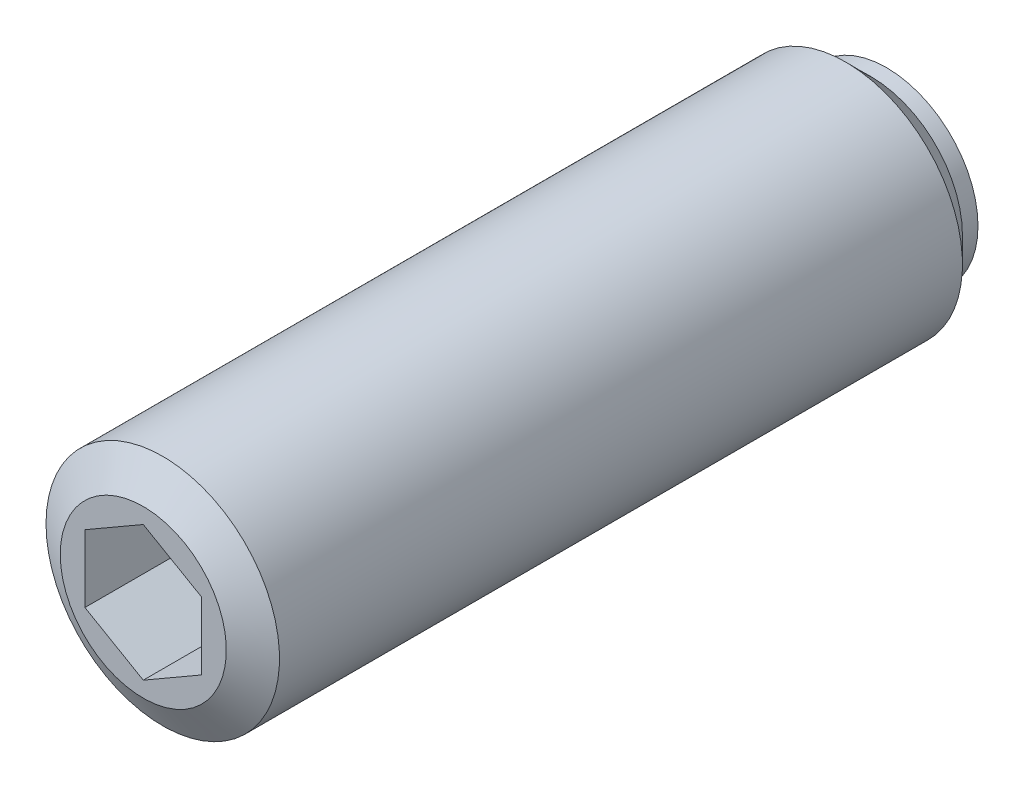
ISO-10303-21;
HEADER;
FILE_DESCRIPTION(('STEP AP214'),'2;1');
FILE_NAME('part.step','',(''),(''),'','','');
FILE_SCHEMA(('AUTOMOTIVE_DESIGN { 1 0 10303 214 1 1 1 1 }'));
ENDSEC;
DATA;
#1=APPLICATION_CONTEXT('core data for automotive mechanical design processes');
#2=APPLICATION_PROTOCOL_DEFINITION('international standard','automotive_design',2000,#1);
#3=PRODUCT_CONTEXT('',#1,'mechanical');
#4=PRODUCT('Part','Part','',(#3));
#5=PRODUCT_RELATED_PRODUCT_CATEGORY('part','',(#4));
#6=PRODUCT_DEFINITION_FORMATION('','',#4);
#7=PRODUCT_DEFINITION_CONTEXT('part definition',#1,'design');
#8=PRODUCT_DEFINITION('design','',#6,#7);
#9=PRODUCT_DEFINITION_SHAPE('','',#8);
#10=(LENGTH_UNIT() NAMED_UNIT(*) SI_UNIT(.MILLI.,.METRE.));
#11=(NAMED_UNIT(*) PLANE_ANGLE_UNIT() SI_UNIT($,.RADIAN.));
#12=(NAMED_UNIT(*) SI_UNIT($,.STERADIAN.) SOLID_ANGLE_UNIT());
#13=UNCERTAINTY_MEASURE_WITH_UNIT(LENGTH_MEASURE(1.E-05),#10,'distance_accuracy_value','');
#14=(GEOMETRIC_REPRESENTATION_CONTEXT(3) GLOBAL_UNCERTAINTY_ASSIGNED_CONTEXT((#13)) GLOBAL_UNIT_ASSIGNED_CONTEXT((#10,
#11,#12)) REPRESENTATION_CONTEXT('',''));
#15=CARTESIAN_POINT('',(0.,0.,0.));
#16=DIRECTION('',(0.,0.,1.));
#17=DIRECTION('',(1.,0.,0.));
#18=AXIS2_PLACEMENT_3D('',#15,#16,#17);
#19=CARTESIAN_POINT('',(0.,0.,2.));
#20=DIRECTION('',(0.,0.,1.));
#21=DIRECTION('',(0.,-1.,0.));
#22=AXIS2_PLACEMENT_3D('',#19,#20,#21);
#23=SPHERICAL_SURFACE('',#22,2.);
#24=CARTESIAN_POINT('',(0.,0.,0.9));
#25=DIRECTION('',(0.,0.,1.));
#26=DIRECTION('',(-1.,0.,0.));
#27=AXIS2_PLACEMENT_3D('',#24,#25,#26);
#28=CIRCLE('',#27,1.67032930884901);
#29=CARTESIAN_POINT('',(-1.67032930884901,0.,0.9));
#30=VERTEX_POINT('',#29);
#31=EDGE_CURVE('E9',#30,#30,#28,.T.);
#32=ORIENTED_EDGE('',*,*,#31,.F.);
#33=EDGE_LOOP('',(#32));
#34=FACE_BOUND('',#33,.T.);
#35=ADVANCED_FACE('F14',(#34),#23,.T.);
#36=CARTESIAN_POINT('',(0.,2.35,0.9));
#37=DIRECTION('',(0.,0.,1.));
#38=DIRECTION('',(-1.,0.,0.));
#39=AXIS2_PLACEMENT_3D('',#36,#37,#38);
#40=PLANE('',#39);
#41=CARTESIAN_POINT('',(0.,0.,0.9));
#42=DIRECTION('',(0.,0.,1.));
#43=DIRECTION('',(-1.,0.,0.));
#44=AXIS2_PLACEMENT_3D('',#41,#42,#43);
#45=CIRCLE('',#44,2.35);
#46=CARTESIAN_POINT('',(-2.35,0.,0.9));
#47=VERTEX_POINT('',#46);
#48=EDGE_CURVE('E21',#47,#47,#45,.T.);
#49=ORIENTED_EDGE('',*,*,#48,.F.);
#50=EDGE_LOOP('',(#49));
#51=FACE_BOUND('',#50,.T.);
#52=ORIENTED_EDGE('',*,*,#31,.T.);
#53=EDGE_LOOP('',(#52));
#54=FACE_BOUND('',#53,.T.);
#55=ADVANCED_FACE('F138',(#51,#54),#40,.F.);
#56=CARTESIAN_POINT('',(0.,0.,21.3950749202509));
#57=DIRECTION('',(0.,0.,1.));
#58=DIRECTION('',(-1.,0.,0.));
#59=AXIS2_PLACEMENT_3D('',#56,#57,#58);
#60=CYLINDRICAL_SURFACE('',#59,2.35);
#61=CARTESIAN_POINT('',(0.,0.,1.3));
#62=DIRECTION('',(0.,0.,1.));
#63=DIRECTION('',(-1.,0.,0.));
#64=AXIS2_PLACEMENT_3D('',#61,#62,#63);
#65=CIRCLE('',#64,2.35);
#66=CARTESIAN_POINT('',(-2.35,0.,1.3));
#67=VERTEX_POINT('',#66);
#68=EDGE_CURVE('E131',#67,#67,#65,.T.);
#69=ORIENTED_EDGE('',*,*,#68,.F.);
#70=EDGE_LOOP('',(#69));
#71=FACE_BOUND('',#70,.T.);
#72=ORIENTED_EDGE('',*,*,#48,.T.);
#73=EDGE_LOOP('',(#72));
#74=FACE_BOUND('',#73,.T.);
#75=ADVANCED_FACE('F136',(#71,#74),#60,.T.);
#76=CARTESIAN_POINT('',(0.,0.,1.3));
#77=DIRECTION('',(0.,0.,1.));
#78=DIRECTION('',(-1.,0.,0.));
#79=AXIS2_PLACEMENT_3D('',#76,#77,#78);
#80=CONICAL_SURFACE('',#79,2.35,0.785398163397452);
#81=CARTESIAN_POINT('',(0.,0.,1.95));
#82=DIRECTION('',(0.,0.,1.));
#83=DIRECTION('',(-1.,0.,0.));
#84=AXIS2_PLACEMENT_3D('',#81,#82,#83);
#85=CIRCLE('',#84,3.);
#86=CARTESIAN_POINT('',(-3.,0.,1.95));
#87=VERTEX_POINT('',#86);
#88=EDGE_CURVE('E128',#87,#87,#85,.T.);
#89=ORIENTED_EDGE('',*,*,#88,.F.);
#90=EDGE_LOOP('',(#89));
#91=FACE_BOUND('',#90,.T.);
#92=ORIENTED_EDGE('',*,*,#68,.T.);
#93=EDGE_LOOP('',(#92));
#94=FACE_BOUND('',#93,.T.);
#95=ADVANCED_FACE('F161',(#91,#94),#80,.T.);
#96=CARTESIAN_POINT('',(0.,0.,21.3950749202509));
#97=DIRECTION('',(0.,0.,1.));
#98=DIRECTION('',(-1.,0.,0.));
#99=AXIS2_PLACEMENT_3D('',#96,#97,#98);
#100=CYLINDRICAL_SURFACE('',#99,3.);
#101=CARTESIAN_POINT('',(0.,0.,19.5));
#102=DIRECTION('',(0.,0.,1.));
#103=DIRECTION('',(-1.,0.,0.));
#104=AXIS2_PLACEMENT_3D('',#101,#102,#103);
#105=CIRCLE('',#104,3.);
#106=CARTESIAN_POINT('',(-3.,0.,19.5));
#107=VERTEX_POINT('',#106);
#108=EDGE_CURVE('E125',#107,#107,#105,.T.);
#109=ORIENTED_EDGE('',*,*,#108,.F.);
#110=EDGE_LOOP('',(#109));
#111=FACE_BOUND('',#110,.T.);
#112=ORIENTED_EDGE('',*,*,#88,.T.);
#113=EDGE_LOOP('',(#112));
#114=FACE_BOUND('',#113,.T.);
#115=ADVANCED_FACE('F170',(#111,#114),#100,.T.);
#116=CARTESIAN_POINT('',(0.,0.,19.5));
#117=DIRECTION('',(0.,0.,-1.));
#118=DIRECTION('',(1.,0.,0.));
#119=AXIS2_PLACEMENT_3D('',#116,#117,#118);
#120=CONICAL_SURFACE('',#119,3.,1.04719755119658);
#121=CARTESIAN_POINT('',(0.,0.,20.));
#122=DIRECTION('',(0.,0.,1.));
#123=DIRECTION('',(-1.,0.,0.));
#124=AXIS2_PLACEMENT_3D('',#121,#122,#123);
#125=CIRCLE('',#124,2.13397459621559);
#126=CARTESIAN_POINT('',(-2.13397459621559,0.,20.));
#127=VERTEX_POINT('',#126);
#128=EDGE_CURVE('E116',#127,#127,#125,.T.);
#129=ORIENTED_EDGE('',*,*,#128,.F.);
#130=EDGE_LOOP('',(#129));
#131=FACE_BOUND('',#130,.T.);
#132=ORIENTED_EDGE('',*,*,#108,.T.);
#133=EDGE_LOOP('',(#132));
#134=FACE_BOUND('',#133,.T.);
#135=ADVANCED_FACE('F179',(#131,#134),#120,.T.);
#136=CARTESIAN_POINT('',(0.,0.,20.));
#137=DIRECTION('',(0.,0.,-1.));
#138=DIRECTION('',(1.,0.,0.));
#139=AXIS2_PLACEMENT_3D('',#136,#137,#138);
#140=PLANE('',#139);
#141=DIRECTION('',(-0.866025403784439,-0.5,0.));
#142=VECTOR('',#141,1.);
#143=CARTESIAN_POINT('',(0.,1.73205080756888,20.));
#144=LINE('',#143,#142);
#145=CARTESIAN_POINT('',(0.,1.73205080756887,20.));
#146=VERTEX_POINT('',#145);
#147=CARTESIAN_POINT('',(-1.5,0.866025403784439,20.));
#148=VERTEX_POINT('',#147);
#149=EDGE_CURVE('E82',#146,#148,#144,.T.);
#150=ORIENTED_EDGE('',*,*,#149,.F.);
#151=DIRECTION('',(-0.866025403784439,0.5,0.));
#152=VECTOR('',#151,1.);
#153=CARTESIAN_POINT('',(1.5,0.866025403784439,20.));
#154=LINE('',#153,#152);
#155=CARTESIAN_POINT('',(1.5,0.866025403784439,20.));
#156=VERTEX_POINT('',#155);
#157=EDGE_CURVE('E28',#156,#146,#154,.T.);
#158=ORIENTED_EDGE('',*,*,#157,.F.);
#159=DIRECTION('',(0.,1.,0.));
#160=VECTOR('',#159,1.);
#161=CARTESIAN_POINT('',(1.5,-0.866025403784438,20.));
#162=LINE('',#161,#160);
#163=CARTESIAN_POINT('',(1.5,-0.866025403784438,20.));
#164=VERTEX_POINT('',#163);
#165=EDGE_CURVE('E98',#164,#156,#162,.T.);
#166=ORIENTED_EDGE('',*,*,#165,.F.);
#167=DIRECTION('',(0.866025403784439,0.5,0.));
#168=VECTOR('',#167,1.);
#169=CARTESIAN_POINT('',(0.,-1.73205080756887,20.));
#170=LINE('',#169,#168);
#171=CARTESIAN_POINT('',(0.,-1.73205080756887,20.));
#172=VERTEX_POINT('',#171);
#173=EDGE_CURVE('E92',#172,#164,#170,.T.);
#174=ORIENTED_EDGE('',*,*,#173,.F.);
#175=DIRECTION('',(0.866025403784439,-0.5,0.));
#176=VECTOR('',#175,1.);
#177=CARTESIAN_POINT('',(-1.5,-0.86602540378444,20.));
#178=LINE('',#177,#176);
#179=CARTESIAN_POINT('',(-1.5,-0.86602540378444,20.));
#180=VERTEX_POINT('',#179);
#181=EDGE_CURVE('E90',#180,#172,#178,.T.);
#182=ORIENTED_EDGE('',*,*,#181,.F.);
#183=DIRECTION('',(0.,-1.,0.));
#184=VECTOR('',#183,1.);
#185=CARTESIAN_POINT('',(-1.5,0.866025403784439,20.));
#186=LINE('',#185,#184);
#187=EDGE_CURVE('E71',#148,#180,#186,.T.);
#188=ORIENTED_EDGE('',*,*,#187,.F.);
#189=EDGE_LOOP('',(#150,#158,#166,#174,#182,#188));
#190=FACE_BOUND('',#189,.T.);
#191=ORIENTED_EDGE('',*,*,#128,.T.);
#192=EDGE_LOOP('',(#191));
#193=FACE_BOUND('',#192,.T.);
#194=ADVANCED_FACE('F86',(#190,#193),#140,.F.);
#195=CARTESIAN_POINT('',(1.5,0.866025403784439,17.));
#196=DIRECTION('',(0.5,0.866025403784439,0.));
#197=DIRECTION('',(0.866025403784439,-0.5,0.));
#198=AXIS2_PLACEMENT_3D('',#195,#196,#197);
#199=PLANE('',#198);
#200=ORIENTED_EDGE('',*,*,#157,.T.);
#201=DIRECTION('',(0.,0.,1.));
#202=VECTOR('',#201,1.);
#203=CARTESIAN_POINT('',(0.,1.73205080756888,17.));
#204=LINE('',#203,#202);
#205=CARTESIAN_POINT('',(0.,1.73205080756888,17.));
#206=VERTEX_POINT('',#205);
#207=EDGE_CURVE('E79',#206,#146,#204,.T.);
#208=ORIENTED_EDGE('',*,*,#207,.F.);
#209=DIRECTION('',(-0.866025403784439,0.5,0.));
#210=VECTOR('',#209,1.);
#211=CARTESIAN_POINT('',(1.5,0.866025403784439,17.));
#212=LINE('',#211,#210);
#213=CARTESIAN_POINT('',(1.5,0.866025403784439,17.));
#214=VERTEX_POINT('',#213);
#215=EDGE_CURVE('E100',#214,#206,#212,.T.);
#216=ORIENTED_EDGE('',*,*,#215,.F.);
#217=DIRECTION('',(0.,0.,1.));
#218=VECTOR('',#217,1.);
#219=CARTESIAN_POINT('',(1.5,0.866025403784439,17.));
#220=LINE('',#219,#218);
#221=EDGE_CURVE('E35',#214,#156,#220,.T.);
#222=ORIENTED_EDGE('',*,*,#221,.T.);
#223=EDGE_LOOP('',(#200,#208,#216,#222));
#224=FACE_BOUND('',#223,.T.);
#225=ADVANCED_FACE('F196',(#224),#199,.F.);
#226=CARTESIAN_POINT('',(1.5,-0.866025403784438,17.));
#227=DIRECTION('',(1.,0.,0.));
#228=DIRECTION('',(0.,-1.,0.));
#229=AXIS2_PLACEMENT_3D('',#226,#227,#228);
#230=PLANE('',#229);
#231=ORIENTED_EDGE('',*,*,#165,.T.);
#232=ORIENTED_EDGE('',*,*,#221,.F.);
#233=DIRECTION('',(0.,1.,0.));
#234=VECTOR('',#233,1.);
#235=CARTESIAN_POINT('',(1.5,-0.866025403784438,17.));
#236=LINE('',#235,#234);
#237=CARTESIAN_POINT('',(1.5,-0.866025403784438,17.));
#238=VERTEX_POINT('',#237);
#239=EDGE_CURVE('E112',#238,#214,#236,.T.);
#240=ORIENTED_EDGE('',*,*,#239,.F.);
#241=DIRECTION('',(0.,0.,1.));
#242=VECTOR('',#241,1.);
#243=CARTESIAN_POINT('',(1.5,-0.866025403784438,17.));
#244=LINE('',#243,#242);
#245=EDGE_CURVE('E117',#238,#164,#244,.T.);
#246=ORIENTED_EDGE('',*,*,#245,.T.);
#247=EDGE_LOOP('',(#231,#232,#240,#246));
#248=FACE_BOUND('',#247,.T.);
#249=ADVANCED_FACE('F204',(#248),#230,.F.);
#250=CARTESIAN_POINT('',(0.,-1.73205080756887,17.));
#251=DIRECTION('',(0.5,-0.866025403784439,0.));
#252=DIRECTION('',(-0.866025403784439,-0.5,0.));
#253=AXIS2_PLACEMENT_3D('',#250,#251,#252);
#254=PLANE('',#253);
#255=ORIENTED_EDGE('',*,*,#173,.T.);
#256=ORIENTED_EDGE('',*,*,#245,.F.);
#257=DIRECTION('',(0.866025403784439,0.5,0.));
#258=VECTOR('',#257,1.);
#259=CARTESIAN_POINT('',(0.,-1.73205080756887,17.));
#260=LINE('',#259,#258);
#261=CARTESIAN_POINT('',(0.,-1.73205080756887,17.));
#262=VERTEX_POINT('',#261);
#263=EDGE_CURVE('E109',#262,#238,#260,.T.);
#264=ORIENTED_EDGE('',*,*,#263,.F.);
#265=DIRECTION('',(0.,0.,1.));
#266=VECTOR('',#265,1.);
#267=CARTESIAN_POINT('',(0.,-1.73205080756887,17.));
#268=LINE('',#267,#266);
#269=EDGE_CURVE('E119',#262,#172,#268,.T.);
#270=ORIENTED_EDGE('',*,*,#269,.T.);
#271=EDGE_LOOP('',(#255,#256,#264,#270));
#272=FACE_BOUND('',#271,.T.);
#273=ADVANCED_FACE('F212',(#272),#254,.F.);
#274=CARTESIAN_POINT('',(-1.5,-0.86602540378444,17.));
#275=DIRECTION('',(-0.5,-0.866025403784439,0.));
#276=DIRECTION('',(-0.866025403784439,0.5,0.));
#277=AXIS2_PLACEMENT_3D('',#274,#275,#276);
#278=PLANE('',#277);
#279=ORIENTED_EDGE('',*,*,#181,.T.);
#280=ORIENTED_EDGE('',*,*,#269,.F.);
#281=DIRECTION('',(0.866025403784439,-0.5,0.));
#282=VECTOR('',#281,1.);
#283=CARTESIAN_POINT('',(-1.5,-0.86602540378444,17.));
#284=LINE('',#283,#282);
#285=CARTESIAN_POINT('',(-1.5,-0.86602540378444,17.));
#286=VERTEX_POINT('',#285);
#287=EDGE_CURVE('E106',#286,#262,#284,.T.);
#288=ORIENTED_EDGE('',*,*,#287,.F.);
#289=DIRECTION('',(0.,0.,1.));
#290=VECTOR('',#289,1.);
#291=CARTESIAN_POINT('',(-1.5,-0.86602540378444,17.));
#292=LINE('',#291,#290);
#293=EDGE_CURVE('E78',#286,#180,#292,.T.);
#294=ORIENTED_EDGE('',*,*,#293,.T.);
#295=EDGE_LOOP('',(#279,#280,#288,#294));
#296=FACE_BOUND('',#295,.T.);
#297=ADVANCED_FACE('F220',(#296),#278,.F.);
#298=CARTESIAN_POINT('',(-1.5,0.866025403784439,17.));
#299=DIRECTION('',(-1.,0.,0.));
#300=DIRECTION('',(0.,1.,0.));
#301=AXIS2_PLACEMENT_3D('',#298,#299,#300);
#302=PLANE('',#301);
#303=ORIENTED_EDGE('',*,*,#187,.T.);
#304=ORIENTED_EDGE('',*,*,#293,.F.);
#305=DIRECTION('',(0.,-1.,0.));
#306=VECTOR('',#305,1.);
#307=CARTESIAN_POINT('',(-1.5,0.866025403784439,17.));
#308=LINE('',#307,#306);
#309=CARTESIAN_POINT('',(-1.5,0.866025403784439,17.));
#310=VERTEX_POINT('',#309);
#311=EDGE_CURVE('E74',#310,#286,#308,.T.);
#312=ORIENTED_EDGE('',*,*,#311,.F.);
#313=DIRECTION('',(0.,0.,1.));
#314=VECTOR('',#313,1.);
#315=CARTESIAN_POINT('',(-1.5,0.866025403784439,17.));
#316=LINE('',#315,#314);
#317=EDGE_CURVE('E67',#310,#148,#316,.T.);
#318=ORIENTED_EDGE('',*,*,#317,.T.);
#319=EDGE_LOOP('',(#303,#304,#312,#318));
#320=FACE_BOUND('',#319,.T.);
#321=ADVANCED_FACE('F69',(#320),#302,.F.);
#322=CARTESIAN_POINT('',(0.,1.73205080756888,17.));
#323=DIRECTION('',(-0.5,0.866025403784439,0.));
#324=DIRECTION('',(0.866025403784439,0.5,0.));
#325=AXIS2_PLACEMENT_3D('',#322,#323,#324);
#326=PLANE('',#325);
#327=ORIENTED_EDGE('',*,*,#149,.T.);
#328=ORIENTED_EDGE('',*,*,#317,.F.);
#329=DIRECTION('',(-0.866025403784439,-0.5,0.));
#330=VECTOR('',#329,1.);
#331=CARTESIAN_POINT('',(0.,1.73205080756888,17.));
#332=LINE('',#331,#330);
#333=EDGE_CURVE('E103',#206,#310,#332,.T.);
#334=ORIENTED_EDGE('',*,*,#333,.F.);
#335=ORIENTED_EDGE('',*,*,#207,.T.);
#336=EDGE_LOOP('',(#327,#328,#334,#335));
#337=FACE_BOUND('',#336,.T.);
#338=ADVANCED_FACE('F83',(#337),#326,.F.);
#339=CARTESIAN_POINT('',(3.,0.,17.));
#340=DIRECTION('',(0.,0.,-1.));
#341=DIRECTION('',(1.,0.,0.));
#342=AXIS2_PLACEMENT_3D('',#339,#340,#341);
#343=PLANE('',#342);
#344=ORIENTED_EDGE('',*,*,#215,.T.);
#345=ORIENTED_EDGE('',*,*,#333,.T.);
#346=ORIENTED_EDGE('',*,*,#311,.T.);
#347=ORIENTED_EDGE('',*,*,#287,.T.);
#348=ORIENTED_EDGE('',*,*,#263,.T.);
#349=ORIENTED_EDGE('',*,*,#239,.T.);
#350=EDGE_LOOP('',(#344,#345,#346,#347,#348,#349));
#351=FACE_BOUND('',#350,.T.);
#352=ADVANCED_FACE('F244',(#351),#343,.F.);
#353=CLOSED_SHELL('',(#35,#55,#75,#95,#115,#135,#194,#225,#249,#273,#297,#321,#338,#352));
#354=MANIFOLD_SOLID_BREP('B1',#353);
#355=ADVANCED_BREP_SHAPE_REPRESENTATION('',(#18,#354),#14);
#356=SHAPE_DEFINITION_REPRESENTATION(#9,#355);
ENDSEC;
END-ISO-10303-21;
